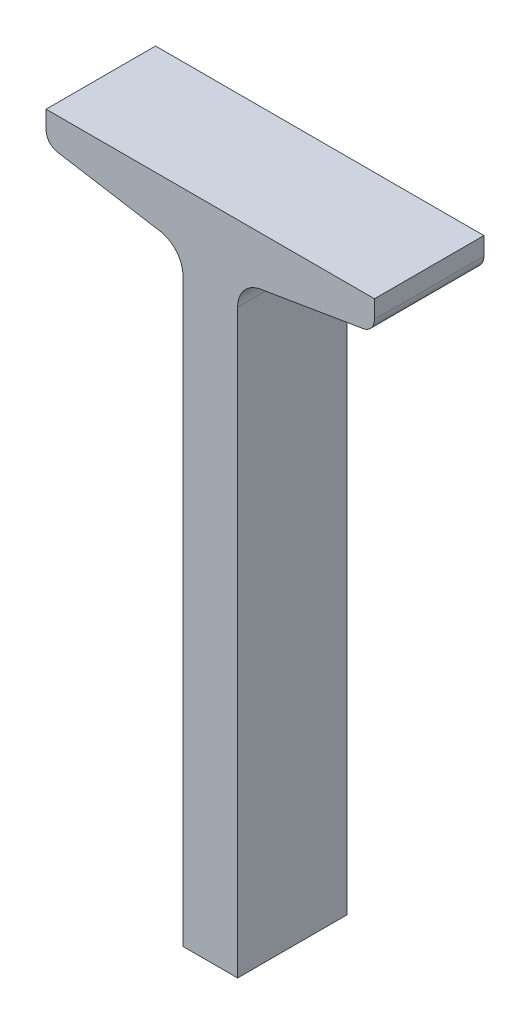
ISO-10303-21;
HEADER;
FILE_DESCRIPTION(('STEP AP214'),'2;1');
FILE_NAME('part.step','',(''),(''),'','','');
FILE_SCHEMA(('AUTOMOTIVE_DESIGN { 1 0 10303 214 1 1 1 1 }'));
ENDSEC;
DATA;
#1=APPLICATION_CONTEXT('core data for automotive mechanical design processes');
#2=APPLICATION_PROTOCOL_DEFINITION('international standard','automotive_design',2000,#1);
#3=PRODUCT_CONTEXT('',#1,'mechanical');
#4=PRODUCT('Part','Part','',(#3));
#5=PRODUCT_RELATED_PRODUCT_CATEGORY('part','',(#4));
#6=PRODUCT_DEFINITION_FORMATION('','',#4);
#7=PRODUCT_DEFINITION_CONTEXT('part definition',#1,'design');
#8=PRODUCT_DEFINITION('design','',#6,#7);
#9=PRODUCT_DEFINITION_SHAPE('','',#8);
#10=(LENGTH_UNIT() NAMED_UNIT(*) SI_UNIT(.MILLI.,.METRE.));
#11=(NAMED_UNIT(*) PLANE_ANGLE_UNIT() SI_UNIT($,.RADIAN.));
#12=(NAMED_UNIT(*) SI_UNIT($,.STERADIAN.) SOLID_ANGLE_UNIT());
#13=UNCERTAINTY_MEASURE_WITH_UNIT(LENGTH_MEASURE(1.E-05),#10,'distance_accuracy_value','');
#14=(GEOMETRIC_REPRESENTATION_CONTEXT(3) GLOBAL_UNCERTAINTY_ASSIGNED_CONTEXT((#13)) GLOBAL_UNIT_ASSIGNED_CONTEXT((#10,
#11,#12)) REPRESENTATION_CONTEXT('',''));
#15=CARTESIAN_POINT('',(0.,0.,0.));
#16=DIRECTION('',(0.,0.,1.));
#17=DIRECTION('',(1.,0.,0.));
#18=AXIS2_PLACEMENT_3D('',#15,#16,#17);
#19=CARTESIAN_POINT('',(0.,0.,12.7));
#20=DIRECTION('',(1.,0.,0.));
#21=DIRECTION('',(0.,1.,0.));
#22=AXIS2_PLACEMENT_3D('',#19,#20,#21);
#23=PLANE('',#22);
#24=DIRECTION('',(0.,-1.,0.));
#25=VECTOR('',#24,1.);
#26=CARTESIAN_POINT('',(0.,0.,-12.7));
#27=LINE('',#26,#25);
#28=CARTESIAN_POINT('',(0.,0.,-12.7));
#29=VERTEX_POINT('',#28);
#30=CARTESIAN_POINT('',(0.,-4.18937694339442,-12.7));
#31=VERTEX_POINT('',#30);
#32=EDGE_CURVE('E175',#29,#31,#27,.T.);
#33=ORIENTED_EDGE('',*,*,#32,.T.);
#34=DIRECTION('',(0.,0.,-1.));
#35=VECTOR('',#34,1.);
#36=CARTESIAN_POINT('',(0.,-4.18937694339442,12.7));
#37=LINE('',#36,#35);
#38=CARTESIAN_POINT('',(0.,-4.18937694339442,12.7));
#39=VERTEX_POINT('',#38);
#40=EDGE_CURVE('E219',#31,#39,#37,.F.);
#41=ORIENTED_EDGE('',*,*,#40,.T.);
#42=DIRECTION('',(0.,-1.,0.));
#43=VECTOR('',#42,1.);
#44=CARTESIAN_POINT('',(0.,0.,12.7));
#45=LINE('',#44,#43);
#46=CARTESIAN_POINT('',(0.,0.,12.7));
#47=VERTEX_POINT('',#46);
#48=EDGE_CURVE('E151',#47,#39,#45,.T.);
#49=ORIENTED_EDGE('',*,*,#48,.F.);
#50=DIRECTION('',(0.,0.,-1.));
#51=VECTOR('',#50,1.);
#52=CARTESIAN_POINT('',(0.,0.,12.7));
#53=LINE('',#52,#51);
#54=EDGE_CURVE('E174',#47,#29,#53,.T.);
#55=ORIENTED_EDGE('',*,*,#54,.T.);
#56=EDGE_LOOP('',(#33,#41,#49,#55));
#57=FACE_BOUND('',#56,.T.);
#58=ADVANCED_FACE('F39',(#57),#23,.F.);
#59=CARTESIAN_POINT('',(26.4440131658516,-11.2866302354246,12.7));
#60=DIRECTION('',(-0.164410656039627,-0.986391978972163,0.));
#61=DIRECTION('',(0.986391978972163,-0.164410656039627,0.));
#62=AXIS2_PLACEMENT_3D('',#59,#60,#61);
#63=PLANE('',#62);
#64=DIRECTION('',(-0.986391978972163,0.164410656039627,0.));
#65=VECTOR('',#64,1.);
#66=CARTESIAN_POINT('',(26.4440131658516,-11.2866302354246,12.7));
#67=LINE('',#66,#65);
#68=CARTESIAN_POINT('',(26.4440131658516,-11.2866302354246,12.7));
#69=VERTEX_POINT('',#68);
#70=CARTESIAN_POINT('',(2.65299616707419,-7.32117147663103,12.7));
#71=VERTEX_POINT('',#70);
#72=EDGE_CURVE('E132',#69,#71,#67,.T.);
#73=ORIENTED_EDGE('',*,*,#72,.T.);
#74=DIRECTION('',(0.,0.,-1.));
#75=VECTOR('',#74,1.);
#76=CARTESIAN_POINT('',(2.65299616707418,-7.32117147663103,-12.7));
#77=LINE('',#76,#75);
#78=CARTESIAN_POINT('',(2.65299616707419,-7.32117147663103,-12.7));
#79=VERTEX_POINT('',#78);
#80=EDGE_CURVE('E140',#71,#79,#77,.T.);
#81=ORIENTED_EDGE('',*,*,#80,.T.);
#82=DIRECTION('',(-0.986391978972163,0.164410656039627,0.));
#83=VECTOR('',#82,1.);
#84=CARTESIAN_POINT('',(26.4440131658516,-11.2866302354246,-12.7));
#85=LINE('',#84,#83);
#86=CARTESIAN_POINT('',(26.4440131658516,-11.2866302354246,-12.7));
#87=VERTEX_POINT('',#86);
#88=EDGE_CURVE('E135',#87,#79,#85,.T.);
#89=ORIENTED_EDGE('',*,*,#88,.F.);
#90=DIRECTION('',(0.,0.,-1.));
#91=VECTOR('',#90,1.);
#92=CARTESIAN_POINT('',(26.4440131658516,-11.2866302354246,12.7));
#93=LINE('',#92,#91);
#94=EDGE_CURVE('E128',#69,#87,#93,.T.);
#95=ORIENTED_EDGE('',*,*,#94,.F.);
#96=EDGE_LOOP('',(#73,#81,#89,#95));
#97=FACE_BOUND('',#96,.T.);
#98=ADVANCED_FACE('F130',(#97),#63,.T.);
#99=CARTESIAN_POINT('',(25.4000055,-17.5502193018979,12.7));
#100=DIRECTION('',(0.,0.,-1.));
#101=DIRECTION('',(-1.,0.,0.));
#102=AXIS2_PLACEMENT_3D('',#99,#100,#101);
#103=CYLINDRICAL_SURFACE('',#102,6.35000000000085);
#104=CARTESIAN_POINT('',(25.4000055,-17.5502193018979,-12.7));
#105=DIRECTION('',(0.,0.,1.));
#106=DIRECTION('',(1.,0.,0.));
#107=AXIS2_PLACEMENT_3D('',#104,#105,#106);
#108=CIRCLE('',#107,6.35000000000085);
#109=CARTESIAN_POINT('',(31.7500055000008,-17.550219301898,-12.7));
#110=VERTEX_POINT('',#109);
#111=EDGE_CURVE('E179',#110,#87,#108,.T.);
#112=ORIENTED_EDGE('',*,*,#111,.F.);
#113=DIRECTION('',(0.,0.,-1.));
#114=VECTOR('',#113,1.);
#115=CARTESIAN_POINT('',(31.7500055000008,-17.550219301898,12.7));
#116=LINE('',#115,#114);
#117=CARTESIAN_POINT('',(31.7500055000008,-17.550219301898,12.7));
#118=VERTEX_POINT('',#117);
#119=EDGE_CURVE('E141',#118,#110,#116,.T.);
#120=ORIENTED_EDGE('',*,*,#119,.F.);
#121=CARTESIAN_POINT('',(25.4000055,-17.5502193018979,12.7));
#122=DIRECTION('',(0.,0.,1.));
#123=DIRECTION('',(1.,0.,0.));
#124=AXIS2_PLACEMENT_3D('',#121,#122,#123);
#125=CIRCLE('',#124,6.35000000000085);
#126=EDGE_CURVE('E147',#118,#69,#125,.T.);
#127=ORIENTED_EDGE('',*,*,#126,.T.);
#128=ORIENTED_EDGE('',*,*,#94,.T.);
#129=EDGE_LOOP('',(#112,#120,#127,#128));
#130=FACE_BOUND('',#129,.T.);
#131=ADVANCED_FACE('F153',(#130),#103,.F.);
#132=CARTESIAN_POINT('',(31.7500055,-152.4,12.7));
#133=DIRECTION('',(-1.,0.,0.));
#134=DIRECTION('',(0.,-1.,0.));
#135=AXIS2_PLACEMENT_3D('',#132,#133,#134);
#136=PLANE('',#135);
#137=DIRECTION('',(0.,1.,0.));
#138=VECTOR('',#137,1.);
#139=CARTESIAN_POINT('',(31.7500055,-152.4,-12.7));
#140=LINE('',#139,#138);
#141=CARTESIAN_POINT('',(31.7500055,-152.4,-12.7));
#142=VERTEX_POINT('',#141);
#143=EDGE_CURVE('E181',#142,#110,#140,.T.);
#144=ORIENTED_EDGE('',*,*,#143,.F.);
#145=DIRECTION('',(0.,0.,-1.));
#146=VECTOR('',#145,1.);
#147=CARTESIAN_POINT('',(31.7500055,-152.4,12.7));
#148=LINE('',#147,#146);
#149=CARTESIAN_POINT('',(31.7500055,-152.4,12.7));
#150=VERTEX_POINT('',#149);
#151=EDGE_CURVE('E211',#150,#142,#148,.T.);
#152=ORIENTED_EDGE('',*,*,#151,.F.);
#153=DIRECTION('',(0.,1.,0.));
#154=VECTOR('',#153,1.);
#155=CARTESIAN_POINT('',(31.7500055,-152.4,12.7));
#156=LINE('',#155,#154);
#157=EDGE_CURVE('E154',#150,#118,#156,.T.);
#158=ORIENTED_EDGE('',*,*,#157,.T.);
#159=ORIENTED_EDGE('',*,*,#119,.T.);
#160=EDGE_LOOP('',(#144,#152,#158,#159));
#161=FACE_BOUND('',#160,.T.);
#162=ADVANCED_FACE('F243',(#161),#136,.T.);
#163=CARTESIAN_POINT('',(31.7500055,-152.4,12.7));
#164=DIRECTION('',(0.,1.,0.));
#165=DIRECTION('',(0.,0.,1.));
#166=AXIS2_PLACEMENT_3D('',#163,#164,#165);
#167=PLANE('',#166);
#168=DIRECTION('',(1.,0.,0.));
#169=VECTOR('',#168,1.);
#170=CARTESIAN_POINT('',(31.7500055,-152.4,-12.7));
#171=LINE('',#170,#169);
#172=CARTESIAN_POINT('',(44.4499945,-152.4,-12.7));
#173=VERTEX_POINT('',#172);
#174=EDGE_CURVE('E184',#142,#173,#171,.T.);
#175=ORIENTED_EDGE('',*,*,#174,.T.);
#176=DIRECTION('',(0.,0.,-1.));
#177=VECTOR('',#176,1.);
#178=CARTESIAN_POINT('',(44.4499945,-152.4,12.7));
#179=LINE('',#178,#177);
#180=CARTESIAN_POINT('',(44.4499945,-152.4,12.7));
#181=VERTEX_POINT('',#180);
#182=EDGE_CURVE('E209',#181,#173,#179,.T.);
#183=ORIENTED_EDGE('',*,*,#182,.F.);
#184=DIRECTION('',(1.,0.,0.));
#185=VECTOR('',#184,1.);
#186=CARTESIAN_POINT('',(31.7500055,-152.4,12.7));
#187=LINE('',#186,#185);
#188=EDGE_CURVE('E156',#150,#181,#187,.T.);
#189=ORIENTED_EDGE('',*,*,#188,.F.);
#190=ORIENTED_EDGE('',*,*,#151,.T.);
#191=EDGE_LOOP('',(#175,#183,#189,#190));
#192=FACE_BOUND('',#191,.T.);
#193=ADVANCED_FACE('F249',(#192),#167,.F.);
#194=CARTESIAN_POINT('',(44.4499945,-17.5502193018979,12.7));
#195=DIRECTION('',(1.,0.,0.));
#196=DIRECTION('',(0.,1.,0.));
#197=AXIS2_PLACEMENT_3D('',#194,#195,#196);
#198=PLANE('',#197);
#199=DIRECTION('',(0.,-1.,0.));
#200=VECTOR('',#199,1.);
#201=CARTESIAN_POINT('',(44.4499945,-17.5502193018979,-12.7));
#202=LINE('',#201,#200);
#203=CARTESIAN_POINT('',(44.4499945,-17.5502193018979,-12.7));
#204=VERTEX_POINT('',#203);
#205=EDGE_CURVE('E187',#204,#173,#202,.T.);
#206=ORIENTED_EDGE('',*,*,#205,.F.);
#207=DIRECTION('',(0.,0.,-1.));
#208=VECTOR('',#207,1.);
#209=CARTESIAN_POINT('',(44.4499945,-17.5502193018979,12.7));
#210=LINE('',#209,#208);
#211=CARTESIAN_POINT('',(44.4499945,-17.5502193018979,12.7));
#212=VERTEX_POINT('',#211);
#213=EDGE_CURVE('E207',#212,#204,#210,.T.);
#214=ORIENTED_EDGE('',*,*,#213,.F.);
#215=DIRECTION('',(0.,-1.,0.));
#216=VECTOR('',#215,1.);
#217=CARTESIAN_POINT('',(44.4499945,-17.5502193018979,12.7));
#218=LINE('',#217,#216);
#219=EDGE_CURVE('E161',#212,#181,#218,.T.);
#220=ORIENTED_EDGE('',*,*,#219,.T.);
#221=ORIENTED_EDGE('',*,*,#182,.T.);
#222=EDGE_LOOP('',(#206,#214,#220,#221));
#223=FACE_BOUND('',#222,.T.);
#224=ADVANCED_FACE('F252',(#223),#198,.T.);
#225=CARTESIAN_POINT('',(50.7999945,-17.5502193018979,12.7));
#226=DIRECTION('',(0.,0.,-1.));
#227=DIRECTION('',(-1.,0.,0.));
#228=AXIS2_PLACEMENT_3D('',#225,#226,#227);
#229=CYLINDRICAL_SURFACE('',#228,6.34999999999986);
#230=CARTESIAN_POINT('',(50.7999945,-17.5502193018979,-12.7));
#231=DIRECTION('',(0.,0.,1.));
#232=DIRECTION('',(1.,0.,0.));
#233=AXIS2_PLACEMENT_3D('',#230,#231,#232);
#234=CIRCLE('',#233,6.34999999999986);
#235=CARTESIAN_POINT('',(49.7559868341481,-11.2866302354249,-12.7));
#236=VERTEX_POINT('',#235);
#237=EDGE_CURVE('E190',#236,#204,#234,.T.);
#238=ORIENTED_EDGE('',*,*,#237,.F.);
#239=DIRECTION('',(0.,0.,-1.));
#240=VECTOR('',#239,1.);
#241=CARTESIAN_POINT('',(49.7559868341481,-11.2866302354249,12.7));
#242=LINE('',#241,#240);
#243=CARTESIAN_POINT('',(49.7559868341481,-11.2866302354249,12.7));
#244=VERTEX_POINT('',#243);
#245=EDGE_CURVE('E204',#244,#236,#242,.T.);
#246=ORIENTED_EDGE('',*,*,#245,.F.);
#247=CARTESIAN_POINT('',(50.7999945,-17.5502193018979,12.7));
#248=DIRECTION('',(0.,0.,1.));
#249=DIRECTION('',(1.,0.,0.));
#250=AXIS2_PLACEMENT_3D('',#247,#248,#249);
#251=CIRCLE('',#250,6.34999999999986);
#252=EDGE_CURVE('E164',#244,#212,#251,.T.);
#253=ORIENTED_EDGE('',*,*,#252,.T.);
#254=ORIENTED_EDGE('',*,*,#213,.T.);
#255=EDGE_LOOP('',(#238,#246,#253,#254));
#256=FACE_BOUND('',#255,.T.);
#257=ADVANCED_FACE('F255',(#256),#229,.F.);
#258=CARTESIAN_POINT('',(76.2,-6.87897319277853,12.7));
#259=DIRECTION('',(0.164410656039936,-0.986391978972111,0.));
#260=DIRECTION('',(0.986391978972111,0.164410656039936,0.));
#261=AXIS2_PLACEMENT_3D('',#258,#259,#260);
#262=PLANE('',#261);
#263=DIRECTION('',(-0.986391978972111,-0.164410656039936,0.));
#264=VECTOR('',#263,1.);
#265=CARTESIAN_POINT('',(76.2,-6.87897319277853,-12.7));
#266=LINE('',#265,#264);
#267=CARTESIAN_POINT('',(73.5470038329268,-7.32117147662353,-12.7));
#268=VERTEX_POINT('',#267);
#269=EDGE_CURVE('E193',#268,#236,#266,.T.);
#270=ORIENTED_EDGE('',*,*,#269,.F.);
#271=DIRECTION('',(0.,0.,-1.));
#272=VECTOR('',#271,1.);
#273=CARTESIAN_POINT('',(73.5470038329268,-7.32117147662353,12.7));
#274=LINE('',#273,#272);
#275=CARTESIAN_POINT('',(73.5470038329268,-7.32117147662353,12.7));
#276=VERTEX_POINT('',#275);
#277=EDGE_CURVE('E11',#268,#276,#274,.F.);
#278=ORIENTED_EDGE('',*,*,#277,.T.);
#279=DIRECTION('',(-0.986391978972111,-0.164410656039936,0.));
#280=VECTOR('',#279,1.);
#281=CARTESIAN_POINT('',(76.2,-6.87897319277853,12.7));
#282=LINE('',#281,#280);
#283=EDGE_CURVE('E167',#276,#244,#282,.T.);
#284=ORIENTED_EDGE('',*,*,#283,.T.);
#285=ORIENTED_EDGE('',*,*,#245,.T.);
#286=EDGE_LOOP('',(#270,#278,#284,#285));
#287=FACE_BOUND('',#286,.T.);
#288=ADVANCED_FACE('F279',(#287),#262,.T.);
#289=CARTESIAN_POINT('',(76.2,0.,12.7));
#290=DIRECTION('',(1.,0.,0.));
#291=DIRECTION('',(0.,0.,-1.));
#292=AXIS2_PLACEMENT_3D('',#289,#290,#291);
#293=PLANE('',#292);
#294=DIRECTION('',(0.,-1.,0.));
#295=VECTOR('',#294,1.);
#296=CARTESIAN_POINT('',(76.2,0.,12.7));
#297=LINE('',#296,#295);
#298=CARTESIAN_POINT('',(76.2,0.,12.7));
#299=VERTEX_POINT('',#298);
#300=CARTESIAN_POINT('',(76.2,-4.18937694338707,12.7));
#301=VERTEX_POINT('',#300);
#302=EDGE_CURVE('E169',#299,#301,#297,.T.);
#303=ORIENTED_EDGE('',*,*,#302,.T.);
#304=DIRECTION('',(0.,0.,-1.));
#305=VECTOR('',#304,1.);
#306=CARTESIAN_POINT('',(76.2,-4.18937694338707,12.7));
#307=LINE('',#306,#305);
#308=CARTESIAN_POINT('',(76.2,-4.18937694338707,-12.7));
#309=VERTEX_POINT('',#308);
#310=EDGE_CURVE('E47',#301,#309,#307,.T.);
#311=ORIENTED_EDGE('',*,*,#310,.T.);
#312=DIRECTION('',(0.,-1.,0.));
#313=VECTOR('',#312,1.);
#314=CARTESIAN_POINT('',(76.2,0.,-12.7));
#315=LINE('',#314,#313);
#316=CARTESIAN_POINT('',(76.2,0.,-12.7));
#317=VERTEX_POINT('',#316);
#318=EDGE_CURVE('E195',#317,#309,#315,.T.);
#319=ORIENTED_EDGE('',*,*,#318,.F.);
#320=DIRECTION('',(0.,0.,-1.));
#321=VECTOR('',#320,1.);
#322=CARTESIAN_POINT('',(76.2,0.,12.7));
#323=LINE('',#322,#321);
#324=EDGE_CURVE('E202',#299,#317,#323,.T.);
#325=ORIENTED_EDGE('',*,*,#324,.F.);
#326=EDGE_LOOP('',(#303,#311,#319,#325));
#327=FACE_BOUND('',#326,.T.);
#328=ADVANCED_FACE('F226',(#327),#293,.T.);
#329=CARTESIAN_POINT('',(0.,0.,12.7));
#330=DIRECTION('',(0.,1.,0.));
#331=DIRECTION('',(-1.,0.,0.));
#332=AXIS2_PLACEMENT_3D('',#329,#330,#331);
#333=PLANE('',#332);
#334=DIRECTION('',(1.,0.,0.));
#335=VECTOR('',#334,1.);
#336=CARTESIAN_POINT('',(0.,0.,-12.7));
#337=LINE('',#336,#335);
#338=EDGE_CURVE('E198',#29,#317,#337,.T.);
#339=ORIENTED_EDGE('',*,*,#338,.F.);
#340=ORIENTED_EDGE('',*,*,#54,.F.);
#341=DIRECTION('',(1.,0.,0.));
#342=VECTOR('',#341,1.);
#343=CARTESIAN_POINT('',(0.,0.,12.7));
#344=LINE('',#343,#342);
#345=EDGE_CURVE('E171',#47,#299,#344,.T.);
#346=ORIENTED_EDGE('',*,*,#345,.T.);
#347=ORIENTED_EDGE('',*,*,#324,.T.);
#348=EDGE_LOOP('',(#339,#340,#346,#347));
#349=FACE_BOUND('',#348,.T.);
#350=ADVANCED_FACE('F233',(#349),#333,.T.);
#351=CARTESIAN_POINT('',(25.4000055,-17.5502193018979,12.7));
#352=DIRECTION('',(0.,0.,1.));
#353=DIRECTION('',(1.,0.,0.));
#354=AXIS2_PLACEMENT_3D('',#351,#352,#353);
#355=PLANE('',#354);
#356=ORIENTED_EDGE('',*,*,#48,.T.);
#357=CARTESIAN_POINT('',(3.175,-4.18937694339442,12.7));
#358=DIRECTION('',(0.,0.,1.));
#359=DIRECTION('',(1.,0.,0.));
#360=AXIS2_PLACEMENT_3D('',#357,#358,#359);
#361=CIRCLE('',#360,3.175);
#362=EDGE_CURVE('E150',#39,#71,#361,.T.);
#363=ORIENTED_EDGE('',*,*,#362,.T.);
#364=ORIENTED_EDGE('',*,*,#72,.F.);
#365=ORIENTED_EDGE('',*,*,#126,.F.);
#366=ORIENTED_EDGE('',*,*,#157,.F.);
#367=ORIENTED_EDGE('',*,*,#188,.T.);
#368=ORIENTED_EDGE('',*,*,#219,.F.);
#369=ORIENTED_EDGE('',*,*,#252,.F.);
#370=ORIENTED_EDGE('',*,*,#283,.F.);
#371=CARTESIAN_POINT('',(73.025,-4.18937694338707,12.7));
#372=DIRECTION('',(0.,0.,1.));
#373=DIRECTION('',(1.,0.,0.));
#374=AXIS2_PLACEMENT_3D('',#371,#372,#373);
#375=CIRCLE('',#374,3.175);
#376=EDGE_CURVE('E54',#276,#301,#375,.T.);
#377=ORIENTED_EDGE('',*,*,#376,.T.);
#378=ORIENTED_EDGE('',*,*,#302,.F.);
#379=ORIENTED_EDGE('',*,*,#345,.F.);
#380=EDGE_LOOP('',(#356,#363,#364,#365,#366,#367,#368,#369,#370,#377,#378,#379));
#381=FACE_BOUND('',#380,.T.);
#382=ADVANCED_FACE('F145',(#381),#355,.T.);
#383=CARTESIAN_POINT('',(25.4000055,-17.5502193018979,-12.7));
#384=DIRECTION('',(0.,0.,1.));
#385=DIRECTION('',(1.,0.,0.));
#386=AXIS2_PLACEMENT_3D('',#383,#384,#385);
#387=PLANE('',#386);
#388=ORIENTED_EDGE('',*,*,#88,.T.);
#389=CARTESIAN_POINT('',(3.175,-4.18937694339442,-12.7));
#390=DIRECTION('',(0.,0.,1.));
#391=DIRECTION('',(1.,0.,0.));
#392=AXIS2_PLACEMENT_3D('',#389,#390,#391);
#393=CIRCLE('',#392,3.175);
#394=EDGE_CURVE('E217',#79,#31,#393,.F.);
#395=ORIENTED_EDGE('',*,*,#394,.T.);
#396=ORIENTED_EDGE('',*,*,#32,.F.);
#397=ORIENTED_EDGE('',*,*,#338,.T.);
#398=ORIENTED_EDGE('',*,*,#318,.T.);
#399=CARTESIAN_POINT('',(73.025,-4.18937694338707,-12.7));
#400=DIRECTION('',(0.,0.,1.));
#401=DIRECTION('',(1.,0.,0.));
#402=AXIS2_PLACEMENT_3D('',#399,#400,#401);
#403=CIRCLE('',#402,3.175);
#404=EDGE_CURVE('E215',#309,#268,#403,.F.);
#405=ORIENTED_EDGE('',*,*,#404,.T.);
#406=ORIENTED_EDGE('',*,*,#269,.T.);
#407=ORIENTED_EDGE('',*,*,#237,.T.);
#408=ORIENTED_EDGE('',*,*,#205,.T.);
#409=ORIENTED_EDGE('',*,*,#174,.F.);
#410=ORIENTED_EDGE('',*,*,#143,.T.);
#411=ORIENTED_EDGE('',*,*,#111,.T.);
#412=EDGE_LOOP('',(#388,#395,#396,#397,#398,#405,#406,#407,#408,#409,#410,#411));
#413=FACE_BOUND('',#412,.T.);
#414=ADVANCED_FACE('F229',(#413),#387,.F.);
#415=CARTESIAN_POINT('',(3.175,-4.18937694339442,12.7));
#416=DIRECTION('',(0.,0.,1.));
#417=DIRECTION('',(1.,0.,0.));
#418=AXIS2_PLACEMENT_3D('',#415,#416,#417);
#419=CYLINDRICAL_SURFACE('',#418,3.175);
#420=ORIENTED_EDGE('',*,*,#362,.F.);
#421=ORIENTED_EDGE('',*,*,#40,.F.);
#422=ORIENTED_EDGE('',*,*,#394,.F.);
#423=ORIENTED_EDGE('',*,*,#80,.F.);
#424=EDGE_LOOP('',(#420,#421,#422,#423));
#425=FACE_BOUND('',#424,.T.);
#426=ADVANCED_FACE('F239',(#425),#419,.T.);
#427=CARTESIAN_POINT('',(73.025,-4.18937694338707,12.7));
#428=DIRECTION('',(0.,0.,-1.));
#429=DIRECTION('',(-1.,0.,0.));
#430=AXIS2_PLACEMENT_3D('',#427,#428,#429);
#431=CYLINDRICAL_SURFACE('',#430,3.175);
#432=ORIENTED_EDGE('',*,*,#376,.F.);
#433=ORIENTED_EDGE('',*,*,#277,.F.);
#434=ORIENTED_EDGE('',*,*,#404,.F.);
#435=ORIENTED_EDGE('',*,*,#310,.F.);
#436=EDGE_LOOP('',(#432,#433,#434,#435));
#437=FACE_BOUND('',#436,.T.);
#438=ADVANCED_FACE('F41',(#437),#431,.T.);
#439=CLOSED_SHELL('',(#58,#98,#131,#162,#193,#224,#257,#288,#328,#350,#382,#414,#426,#438));
#440=MANIFOLD_SOLID_BREP('B2',#439);
#441=ADVANCED_BREP_SHAPE_REPRESENTATION('',(#18,#440),#14);
#442=SHAPE_DEFINITION_REPRESENTATION(#9,#441);
ENDSEC;
END-ISO-10303-21;
